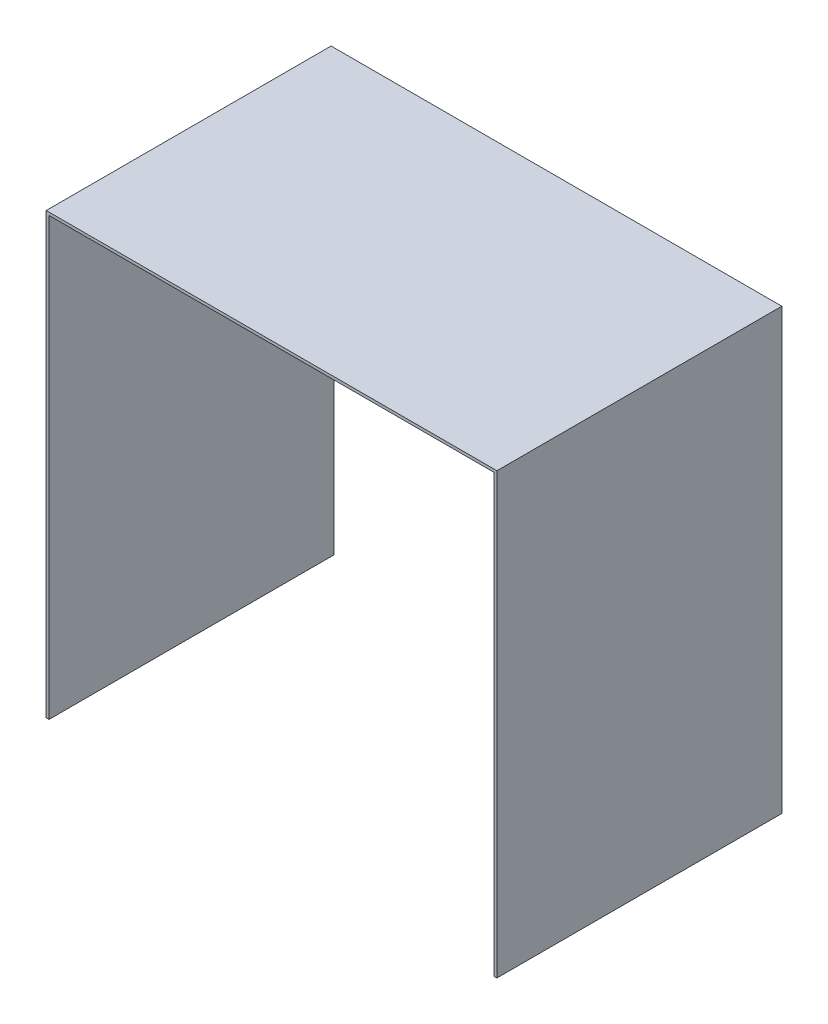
from build123d import *

# Parameters (mm, degrees)
EXTRU_MINCE1_DEPTH = 1000


with BuildPart() as part:
    # Esquisse1 → Extru.-Mince1 (new body)
    with BuildSketch(Plane.XY):
        Polygon((0, 0), (0, 1532), (1562, 1532), (1562, 0), (1572, 0), (1572, 1542), (-10, 1542), (-10, 0), align=None)
    extrude(amount=EXTRU_MINCE1_DEPTH)


solid = part.part
